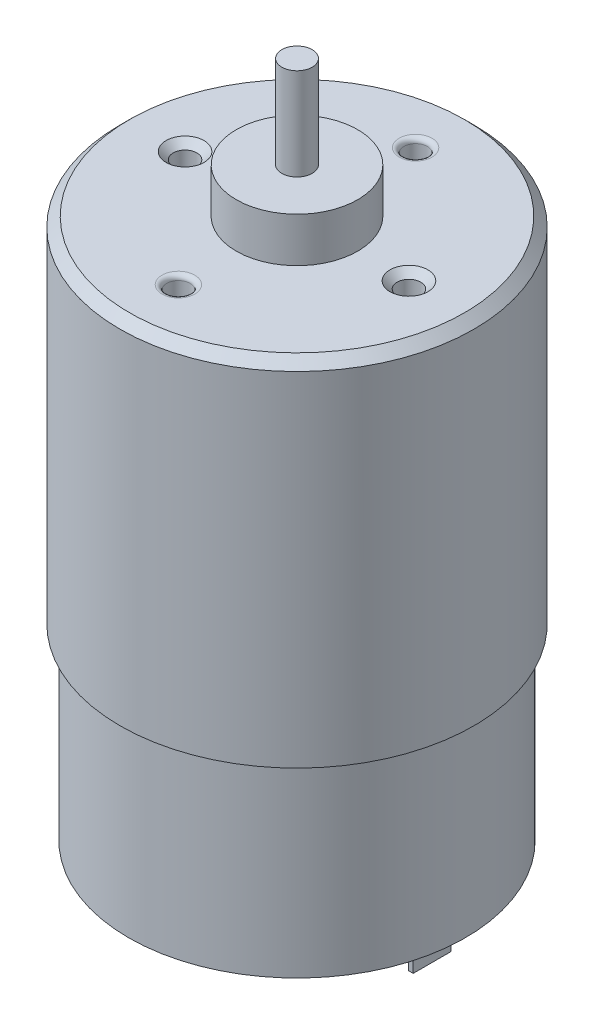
ISO-10303-21;
HEADER;
FILE_DESCRIPTION(('STEP AP214'),'2;1');
FILE_NAME('part.step','',(''),(''),'','','');
FILE_SCHEMA(('AUTOMOTIVE_DESIGN { 1 0 10303 214 1 1 1 1 }'));
ENDSEC;
DATA;
#1=APPLICATION_CONTEXT('core data for automotive mechanical design processes');
#2=APPLICATION_PROTOCOL_DEFINITION('international standard','automotive_design',2000,#1);
#3=PRODUCT_CONTEXT('',#1,'mechanical');
#4=PRODUCT('Part','Part','',(#3));
#5=PRODUCT_RELATED_PRODUCT_CATEGORY('part','',(#4));
#6=PRODUCT_DEFINITION_FORMATION('','',#4);
#7=PRODUCT_DEFINITION_CONTEXT('part definition',#1,'design');
#8=PRODUCT_DEFINITION('design','',#6,#7);
#9=PRODUCT_DEFINITION_SHAPE('','',#8);
#10=(LENGTH_UNIT() NAMED_UNIT(*) SI_UNIT(.MILLI.,.METRE.));
#11=(NAMED_UNIT(*) PLANE_ANGLE_UNIT() SI_UNIT($,.RADIAN.));
#12=(NAMED_UNIT(*) SI_UNIT($,.STERADIAN.) SOLID_ANGLE_UNIT());
#13=UNCERTAINTY_MEASURE_WITH_UNIT(LENGTH_MEASURE(1.E-05),#10,'distance_accuracy_value','');
#14=(GEOMETRIC_REPRESENTATION_CONTEXT(3) GLOBAL_UNCERTAINTY_ASSIGNED_CONTEXT((#13)) GLOBAL_UNIT_ASSIGNED_CONTEXT((#10,
#11,#12)) REPRESENTATION_CONTEXT('',''));
#15=CARTESIAN_POINT('',(0.,0.,0.));
#16=DIRECTION('',(0.,0.,1.));
#17=DIRECTION('',(1.,0.,0.));
#18=AXIS2_PLACEMENT_3D('',#15,#16,#17);
#19=CARTESIAN_POINT('',(-1.63199999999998,75.,-1.59999999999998));
#20=DIRECTION('',(0.,1.,0.));
#21=DIRECTION('',(0.,0.,1.));
#22=AXIS2_PLACEMENT_3D('',#19,#20,#21);
#23=PLANE('',#22);
#24=CARTESIAN_POINT('',(0.,75.,0.));
#25=DIRECTION('',(0.,1.,0.));
#26=DIRECTION('',(0.,0.,1.));
#27=AXIS2_PLACEMENT_3D('',#24,#25,#26);
#28=CIRCLE('',#27,1.59999999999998);
#29=CARTESIAN_POINT('',(0.,75.,1.59999999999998));
#30=VERTEX_POINT('',#29);
#31=EDGE_CURVE('E334',#30,#30,#28,.T.);
#32=ORIENTED_EDGE('',*,*,#31,.T.);
#33=EDGE_LOOP('',(#32));
#34=FACE_BOUND('',#33,.T.);
#35=ADVANCED_FACE('F21',(#34),#23,.T.);
#36=CARTESIAN_POINT('',(0.,65.3,0.));
#37=DIRECTION('',(0.,1.,0.));
#38=DIRECTION('',(0.,0.,1.));
#39=AXIS2_PLACEMENT_3D('',#36,#37,#38);
#40=CYLINDRICAL_SURFACE('',#39,1.59999999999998);
#41=ORIENTED_EDGE('',*,*,#31,.F.);
#42=EDGE_LOOP('',(#41));
#43=FACE_BOUND('',#42,.T.);
#44=CARTESIAN_POINT('',(0.,65.3,0.));
#45=DIRECTION('',(0.,1.,0.));
#46=DIRECTION('',(0.,0.,1.));
#47=AXIS2_PLACEMENT_3D('',#44,#45,#46);
#48=CIRCLE('',#47,1.59999999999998);
#49=CARTESIAN_POINT('',(0.,65.3,1.59999999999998));
#50=VERTEX_POINT('',#49);
#51=EDGE_CURVE('E330',#50,#50,#48,.T.);
#52=ORIENTED_EDGE('',*,*,#51,.T.);
#53=EDGE_LOOP('',(#52));
#54=FACE_BOUND('',#53,.T.);
#55=ADVANCED_FACE('F920',(#43,#54),#40,.T.);
#56=CARTESIAN_POINT('',(-6.528,65.3,-6.4));
#57=DIRECTION('',(0.,1.,0.));
#58=DIRECTION('',(0.,0.,1.));
#59=AXIS2_PLACEMENT_3D('',#56,#57,#58);
#60=PLANE('',#59);
#61=ORIENTED_EDGE('',*,*,#51,.F.);
#62=EDGE_LOOP('',(#61));
#63=FACE_BOUND('',#62,.T.);
#64=CARTESIAN_POINT('',(0.,65.3,0.));
#65=DIRECTION('',(0.,1.,0.));
#66=DIRECTION('',(0.,0.,1.));
#67=AXIS2_PLACEMENT_3D('',#64,#65,#66);
#68=CIRCLE('',#67,6.4);
#69=CARTESIAN_POINT('',(0.,65.3,6.4));
#70=VERTEX_POINT('',#69);
#71=EDGE_CURVE('E324',#70,#70,#68,.T.);
#72=ORIENTED_EDGE('',*,*,#71,.T.);
#73=EDGE_LOOP('',(#72));
#74=FACE_BOUND('',#73,.T.);
#75=ADVANCED_FACE('F910',(#63,#74),#60,.T.);
#76=CARTESIAN_POINT('',(0.,60.1,-12.5));
#77=DIRECTION('',(0.,-1.,0.));
#78=DIRECTION('',(0.,0.,-1.));
#79=AXIS2_PLACEMENT_3D('',#76,#77,#78);
#80=TOROIDAL_SURFACE('',#79,1.72950000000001,0.500000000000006);
#81=CARTESIAN_POINT('',(0.,60.1,-12.5));
#82=DIRECTION('',(0.,-1.,0.));
#83=DIRECTION('',(0.,0.,-1.));
#84=AXIS2_PLACEMENT_3D('',#81,#82,#83);
#85=CIRCLE('',#84,1.2295);
#86=CARTESIAN_POINT('',(0.,60.1,-13.7295));
#87=VERTEX_POINT('',#86);
#88=EDGE_CURVE('E289',#87,#87,#85,.T.);
#89=ORIENTED_EDGE('',*,*,#88,.T.);
#90=EDGE_LOOP('',(#89));
#91=FACE_BOUND('',#90,.T.);
#92=CARTESIAN_POINT('',(0.,60.6,-12.5));
#93=DIRECTION('',(0.,-1.,0.));
#94=DIRECTION('',(0.,0.,-1.));
#95=AXIS2_PLACEMENT_3D('',#92,#93,#94);
#96=CIRCLE('',#95,1.7295);
#97=CARTESIAN_POINT('',(0.,60.6,-14.2295));
#98=VERTEX_POINT('',#97);
#99=EDGE_CURVE('E25',#98,#98,#96,.F.);
#100=ORIENTED_EDGE('',*,*,#99,.T.);
#101=EDGE_LOOP('',(#100));
#102=FACE_BOUND('',#101,.T.);
#103=ADVANCED_FACE('F900',(#91,#102),#80,.T.);
#104=CARTESIAN_POINT('',(0.,51.8,-12.5));
#105=DIRECTION('',(0.,1.,0.));
#106=DIRECTION('',(0.,0.,1.));
#107=AXIS2_PLACEMENT_3D('',#104,#105,#106);
#108=CYLINDRICAL_SURFACE('',#107,1.2295);
#109=CARTESIAN_POINT('',(0.,51.8,-12.5));
#110=DIRECTION('',(0.,1.,0.));
#111=DIRECTION('',(0.,0.,1.));
#112=AXIS2_PLACEMENT_3D('',#109,#110,#111);
#113=CIRCLE('',#112,1.2295);
#114=CARTESIAN_POINT('',(0.,51.8,-11.2705));
#115=VERTEX_POINT('',#114);
#116=EDGE_CURVE('E294',#115,#115,#113,.F.);
#117=ORIENTED_EDGE('',*,*,#116,.T.);
#118=EDGE_LOOP('',(#117));
#119=FACE_BOUND('',#118,.T.);
#120=ORIENTED_EDGE('',*,*,#88,.F.);
#121=EDGE_LOOP('',(#120));
#122=FACE_BOUND('',#121,.T.);
#123=ADVANCED_FACE('F890',(#119,#122),#108,.F.);
#124=CARTESIAN_POINT('',(-18.0029999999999,60.6,-17.6499999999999));
#125=DIRECTION('',(0.,1.,0.));
#126=DIRECTION('',(0.,0.,1.));
#127=AXIS2_PLACEMENT_3D('',#124,#125,#126);
#128=PLANE('',#127);
#129=ORIENTED_EDGE('',*,*,#99,.F.);
#130=EDGE_LOOP('',(#129));
#131=FACE_BOUND('',#130,.T.);
#132=CARTESIAN_POINT('',(0.,60.6,0.));
#133=DIRECTION('',(0.,1.,0.));
#134=DIRECTION('',(0.,0.,1.));
#135=AXIS2_PLACEMENT_3D('',#132,#133,#134);
#136=CIRCLE('',#135,6.4);
#137=CARTESIAN_POINT('',(0.,60.6,6.4));
#138=VERTEX_POINT('',#137);
#139=EDGE_CURVE('E1104',#138,#138,#136,.F.);
#140=ORIENTED_EDGE('',*,*,#139,.T.);
#141=EDGE_LOOP('',(#140));
#142=FACE_BOUND('',#141,.T.);
#143=CARTESIAN_POINT('',(-11.8,60.6,0.));
#144=DIRECTION('',(0.,1.,0.));
#145=DIRECTION('',(-1.,0.,0.));
#146=AXIS2_PLACEMENT_3D('',#143,#144,#145);
#147=CIRCLE('',#146,1.99999999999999);
#148=CARTESIAN_POINT('',(-13.8,60.6,0.));
#149=VERTEX_POINT('',#148);
#150=EDGE_CURVE('E1108',#149,#149,#147,.F.);
#151=ORIENTED_EDGE('',*,*,#150,.T.);
#152=EDGE_LOOP('',(#151));
#153=FACE_BOUND('',#152,.T.);
#154=CARTESIAN_POINT('',(11.8,60.6,0.));
#155=DIRECTION('',(0.,1.,0.));
#156=DIRECTION('',(0.,0.,1.));
#157=AXIS2_PLACEMENT_3D('',#154,#155,#156);
#158=CIRCLE('',#157,1.99999999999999);
#159=CARTESIAN_POINT('',(11.8,60.6,1.99999999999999));
#160=VERTEX_POINT('',#159);
#161=EDGE_CURVE('E307',#160,#160,#158,.F.);
#162=ORIENTED_EDGE('',*,*,#161,.T.);
#163=EDGE_LOOP('',(#162));
#164=FACE_BOUND('',#163,.T.);
#165=CARTESIAN_POINT('',(0.,60.6,12.5));
#166=DIRECTION('',(0.,-1.,0.));
#167=DIRECTION('',(0.,0.,-1.));
#168=AXIS2_PLACEMENT_3D('',#165,#166,#167);
#169=CIRCLE('',#168,1.7295);
#170=CARTESIAN_POINT('',(0.,60.6,10.7705));
#171=VERTEX_POINT('',#170);
#172=EDGE_CURVE('E302',#171,#171,#169,.T.);
#173=ORIENTED_EDGE('',*,*,#172,.T.);
#174=EDGE_LOOP('',(#173));
#175=FACE_BOUND('',#174,.T.);
#176=CARTESIAN_POINT('',(0.,60.6,0.));
#177=DIRECTION('',(0.,-1.,0.));
#178=DIRECTION('',(0.,0.,-1.));
#179=AXIS2_PLACEMENT_3D('',#176,#177,#178);
#180=CIRCLE('',#179,17.6499999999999);
#181=CARTESIAN_POINT('',(0.,60.6,-17.6499999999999));
#182=VERTEX_POINT('',#181);
#183=EDGE_CURVE('E298',#182,#182,#180,.F.);
#184=ORIENTED_EDGE('',*,*,#183,.T.);
#185=EDGE_LOOP('',(#184));
#186=FACE_BOUND('',#185,.T.);
#187=ADVANCED_FACE('F880',(#131,#142,#153,#164,#175,#186),#128,.T.);
#188=CARTESIAN_POINT('',(0.,60.6,0.));
#189=DIRECTION('',(0.,1.,0.));
#190=DIRECTION('',(0.,0.,1.));
#191=AXIS2_PLACEMENT_3D('',#188,#189,#190);
#192=CYLINDRICAL_SURFACE('',#191,6.4);
#193=ORIENTED_EDGE('',*,*,#71,.F.);
#194=EDGE_LOOP('',(#193));
#195=FACE_BOUND('',#194,.T.);
#196=ORIENTED_EDGE('',*,*,#139,.F.);
#197=EDGE_LOOP('',(#196));
#198=FACE_BOUND('',#197,.T.);
#199=ADVANCED_FACE('F870',(#195,#198),#192,.T.);
#200=CARTESIAN_POINT('',(-11.8,59.85,0.));
#201=DIRECTION('',(0.,1.,0.));
#202=DIRECTION('',(-1.,0.,0.));
#203=AXIS2_PLACEMENT_3D('',#200,#201,#202);
#204=CONICAL_SURFACE('',#203,1.25,0.785398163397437);
#205=CARTESIAN_POINT('',(-11.8,59.85,0.));
#206=DIRECTION('',(0.,1.,0.));
#207=DIRECTION('',(-1.,0.,0.));
#208=AXIS2_PLACEMENT_3D('',#205,#206,#207);
#209=CIRCLE('',#208,1.24999999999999);
#210=CARTESIAN_POINT('',(-13.05,59.85,0.));
#211=VERTEX_POINT('',#210);
#212=EDGE_CURVE('E1100',#211,#211,#209,.F.);
#213=ORIENTED_EDGE('',*,*,#212,.T.);
#214=EDGE_LOOP('',(#213));
#215=FACE_BOUND('',#214,.T.);
#216=ORIENTED_EDGE('',*,*,#150,.F.);
#217=EDGE_LOOP('',(#216));
#218=FACE_BOUND('',#217,.T.);
#219=ADVANCED_FACE('F860',(#215,#218),#204,.F.);
#220=CARTESIAN_POINT('',(11.8,59.85,0.));
#221=DIRECTION('',(0.,1.,0.));
#222=DIRECTION('',(0.,0.,1.));
#223=AXIS2_PLACEMENT_3D('',#220,#221,#222);
#224=CONICAL_SURFACE('',#223,1.25,0.785398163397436);
#225=CARTESIAN_POINT('',(11.8,59.85,0.));
#226=DIRECTION('',(0.,1.,0.));
#227=DIRECTION('',(0.,0.,1.));
#228=AXIS2_PLACEMENT_3D('',#225,#226,#227);
#229=CIRCLE('',#228,1.24999999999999);
#230=CARTESIAN_POINT('',(11.8,59.85,1.24999999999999));
#231=VERTEX_POINT('',#230);
#232=EDGE_CURVE('E1097',#231,#231,#229,.F.);
#233=ORIENTED_EDGE('',*,*,#232,.T.);
#234=EDGE_LOOP('',(#233));
#235=FACE_BOUND('',#234,.T.);
#236=ORIENTED_EDGE('',*,*,#161,.F.);
#237=EDGE_LOOP('',(#236));
#238=FACE_BOUND('',#237,.T.);
#239=ADVANCED_FACE('F850',(#235,#238),#224,.F.);
#240=CARTESIAN_POINT('',(0.,60.1,12.5));
#241=DIRECTION('',(0.,-1.,0.));
#242=DIRECTION('',(0.,0.,-1.));
#243=AXIS2_PLACEMENT_3D('',#240,#241,#242);
#244=TOROIDAL_SURFACE('',#243,1.72950000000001,0.500000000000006);
#245=CARTESIAN_POINT('',(0.,60.1,12.5));
#246=DIRECTION('',(0.,-1.,0.));
#247=DIRECTION('',(0.,0.,-1.));
#248=AXIS2_PLACEMENT_3D('',#245,#246,#247);
#249=CIRCLE('',#248,1.2295);
#250=CARTESIAN_POINT('',(0.,60.1,11.2705));
#251=VERTEX_POINT('',#250);
#252=EDGE_CURVE('E1093',#251,#251,#249,.T.);
#253=ORIENTED_EDGE('',*,*,#252,.T.);
#254=EDGE_LOOP('',(#253));
#255=FACE_BOUND('',#254,.T.);
#256=ORIENTED_EDGE('',*,*,#172,.F.);
#257=EDGE_LOOP('',(#256));
#258=FACE_BOUND('',#257,.T.);
#259=ADVANCED_FACE('F840',(#255,#258),#244,.T.);
#260=CARTESIAN_POINT('',(0.,59.6,0.));
#261=DIRECTION('',(0.,-1.,0.));
#262=DIRECTION('',(0.,0.,-1.));
#263=AXIS2_PLACEMENT_3D('',#260,#261,#262);
#264=CONICAL_SURFACE('',#263,18.6499999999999,0.785398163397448);
#265=ORIENTED_EDGE('',*,*,#183,.F.);
#266=EDGE_LOOP('',(#265));
#267=FACE_BOUND('',#266,.T.);
#268=CARTESIAN_POINT('',(0.,59.5999999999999,0.));
#269=DIRECTION('',(0.,-1.,0.));
#270=DIRECTION('',(0.,0.,-1.));
#271=AXIS2_PLACEMENT_3D('',#268,#269,#270);
#272=CIRCLE('',#271,18.65);
#273=CARTESIAN_POINT('',(0.,59.5999999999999,-18.65));
#274=VERTEX_POINT('',#273);
#275=EDGE_CURVE('E1089',#274,#274,#272,.F.);
#276=ORIENTED_EDGE('',*,*,#275,.T.);
#277=EDGE_LOOP('',(#276));
#278=FACE_BOUND('',#277,.T.);
#279=ADVANCED_FACE('F830',(#267,#278),#264,.T.);
#280=CARTESIAN_POINT('',(0.,51.0612418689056,-12.5));
#281=DIRECTION('',(0.,1.,0.));
#282=DIRECTION('',(0.,0.,1.));
#283=AXIS2_PLACEMENT_3D('',#280,#281,#282);
#284=CONICAL_SURFACE('',#283,0.,1.02974425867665);
#285=ORIENTED_EDGE('',*,*,#116,.F.);
#286=EDGE_LOOP('',(#285));
#287=FACE_BOUND('',#286,.T.);
#288=CARTESIAN_POINT('',(0.,51.0612418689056,-12.5));
#289=VERTEX_POINT('',#288);
#290=VERTEX_LOOP('',#289);
#291=FACE_BOUND('',#290,.T.);
#292=ADVANCED_FACE('F820',(#287,#291),#284,.F.);
#293=CARTESIAN_POINT('',(0.,51.8,12.5));
#294=DIRECTION('',(0.,1.,0.));
#295=DIRECTION('',(0.,0.,1.));
#296=AXIS2_PLACEMENT_3D('',#293,#294,#295);
#297=CYLINDRICAL_SURFACE('',#296,1.2295);
#298=CARTESIAN_POINT('',(0.,51.8,12.5));
#299=DIRECTION('',(0.,1.,0.));
#300=DIRECTION('',(0.,0.,1.));
#301=AXIS2_PLACEMENT_3D('',#298,#299,#300);
#302=CIRCLE('',#301,1.2295);
#303=CARTESIAN_POINT('',(0.,51.8,13.7295));
#304=VERTEX_POINT('',#303);
#305=EDGE_CURVE('E1085',#304,#304,#302,.F.);
#306=ORIENTED_EDGE('',*,*,#305,.T.);
#307=EDGE_LOOP('',(#306));
#308=FACE_BOUND('',#307,.T.);
#309=ORIENTED_EDGE('',*,*,#252,.F.);
#310=EDGE_LOOP('',(#309));
#311=FACE_BOUND('',#310,.T.);
#312=ADVANCED_FACE('F810',(#308,#311),#297,.F.);
#313=CARTESIAN_POINT('',(0.,51.0612418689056,12.5));
#314=DIRECTION('',(0.,1.,0.));
#315=DIRECTION('',(0.,0.,1.));
#316=AXIS2_PLACEMENT_3D('',#313,#314,#315);
#317=CONICAL_SURFACE('',#316,0.,1.02974425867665);
#318=ORIENTED_EDGE('',*,*,#305,.F.);
#319=EDGE_LOOP('',(#318));
#320=FACE_BOUND('',#319,.T.);
#321=CARTESIAN_POINT('',(0.,51.0612418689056,12.5));
#322=VERTEX_POINT('',#321);
#323=VERTEX_LOOP('',#322);
#324=FACE_BOUND('',#323,.T.);
#325=ADVANCED_FACE('F800',(#320,#324),#317,.F.);
#326=CARTESIAN_POINT('',(11.8,51.0489242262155,0.));
#327=DIRECTION('',(0.,1.,0.));
#328=DIRECTION('',(0.,0.,1.));
#329=AXIS2_PLACEMENT_3D('',#326,#327,#328);
#330=CONICAL_SURFACE('',#329,0.,1.02974425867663);
#331=CARTESIAN_POINT('',(11.8,51.8,0.));
#332=DIRECTION('',(0.,1.,0.));
#333=DIRECTION('',(0.,0.,1.));
#334=AXIS2_PLACEMENT_3D('',#331,#332,#333);
#335=CIRCLE('',#334,1.25);
#336=CARTESIAN_POINT('',(11.8,51.8,1.25));
#337=VERTEX_POINT('',#336);
#338=EDGE_CURVE('E344',#337,#337,#335,.T.);
#339=ORIENTED_EDGE('',*,*,#338,.T.);
#340=EDGE_LOOP('',(#339));
#341=FACE_BOUND('',#340,.T.);
#342=CARTESIAN_POINT('',(11.8,51.0489242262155,0.));
#343=VERTEX_POINT('',#342);
#344=VERTEX_LOOP('',#343);
#345=FACE_BOUND('',#344,.T.);
#346=ADVANCED_FACE('F790',(#341,#345),#330,.F.);
#347=CARTESIAN_POINT('',(11.8,51.8,0.));
#348=DIRECTION('',(0.,1.,0.));
#349=DIRECTION('',(0.,0.,1.));
#350=AXIS2_PLACEMENT_3D('',#347,#348,#349);
#351=CYLINDRICAL_SURFACE('',#350,1.25);
#352=ORIENTED_EDGE('',*,*,#338,.F.);
#353=EDGE_LOOP('',(#352));
#354=FACE_BOUND('',#353,.T.);
#355=ORIENTED_EDGE('',*,*,#232,.F.);
#356=EDGE_LOOP('',(#355));
#357=FACE_BOUND('',#356,.T.);
#358=ADVANCED_FACE('F780',(#354,#357),#351,.F.);
#359=CARTESIAN_POINT('',(-11.8,51.0489242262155,0.));
#360=DIRECTION('',(0.,1.,0.));
#361=DIRECTION('',(0.,0.,1.));
#362=AXIS2_PLACEMENT_3D('',#359,#360,#361);
#363=CONICAL_SURFACE('',#362,0.,1.02974425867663);
#364=CARTESIAN_POINT('',(-11.8,51.8,0.));
#365=DIRECTION('',(0.,1.,0.));
#366=DIRECTION('',(0.,0.,1.));
#367=AXIS2_PLACEMENT_3D('',#364,#365,#366);
#368=CIRCLE('',#367,1.25);
#369=CARTESIAN_POINT('',(-11.8,51.8,1.25));
#370=VERTEX_POINT('',#369);
#371=EDGE_CURVE('E339',#370,#370,#368,.T.);
#372=ORIENTED_EDGE('',*,*,#371,.T.);
#373=EDGE_LOOP('',(#372));
#374=FACE_BOUND('',#373,.T.);
#375=CARTESIAN_POINT('',(-11.8,51.0489242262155,0.));
#376=VERTEX_POINT('',#375);
#377=VERTEX_LOOP('',#376);
#378=FACE_BOUND('',#377,.T.);
#379=ADVANCED_FACE('F770',(#374,#378),#363,.F.);
#380=CARTESIAN_POINT('',(-11.8,51.8,0.));
#381=DIRECTION('',(0.,1.,0.));
#382=DIRECTION('',(0.,0.,1.));
#383=AXIS2_PLACEMENT_3D('',#380,#381,#382);
#384=CYLINDRICAL_SURFACE('',#383,1.25);
#385=ORIENTED_EDGE('',*,*,#371,.F.);
#386=EDGE_LOOP('',(#385));
#387=FACE_BOUND('',#386,.T.);
#388=ORIENTED_EDGE('',*,*,#212,.F.);
#389=EDGE_LOOP('',(#388));
#390=FACE_BOUND('',#389,.T.);
#391=ADVANCED_FACE('F760',(#387,#390),#384,.F.);
#392=CARTESIAN_POINT('',(0.,23.4,0.));
#393=DIRECTION('',(0.,1.,0.));
#394=DIRECTION('',(0.,0.,1.));
#395=AXIS2_PLACEMENT_3D('',#392,#393,#394);
#396=CYLINDRICAL_SURFACE('',#395,18.65);
#397=ORIENTED_EDGE('',*,*,#275,.F.);
#398=EDGE_LOOP('',(#397));
#399=FACE_BOUND('',#398,.T.);
#400=CARTESIAN_POINT('',(0.,23.4,0.));
#401=DIRECTION('',(0.,1.,0.));
#402=DIRECTION('',(0.,0.,1.));
#403=AXIS2_PLACEMENT_3D('',#400,#401,#402);
#404=CIRCLE('',#403,18.65);
#405=CARTESIAN_POINT('',(0.,23.4,18.65));
#406=VERTEX_POINT('',#405);
#407=EDGE_CURVE('E318',#406,#406,#404,.T.);
#408=ORIENTED_EDGE('',*,*,#407,.T.);
#409=EDGE_LOOP('',(#408));
#410=FACE_BOUND('',#409,.T.);
#411=ADVANCED_FACE('F750',(#399,#410),#396,.T.);
#412=CARTESIAN_POINT('',(-19.023,23.4,18.65));
#413=DIRECTION('',(0.,-1.,0.));
#414=DIRECTION('',(0.,0.,-1.));
#415=AXIS2_PLACEMENT_3D('',#412,#413,#414);
#416=PLANE('',#415);
#417=CARTESIAN_POINT('',(0.,23.4,0.));
#418=DIRECTION('',(0.,1.,0.));
#419=DIRECTION('',(0.,0.,1.));
#420=AXIS2_PLACEMENT_3D('',#417,#418,#419);
#421=CIRCLE('',#420,17.75);
#422=CARTESIAN_POINT('',(0.,23.4,17.75));
#423=VERTEX_POINT('',#422);
#424=EDGE_CURVE('E323',#423,#423,#421,.T.);
#425=ORIENTED_EDGE('',*,*,#424,.T.);
#426=EDGE_LOOP('',(#425));
#427=FACE_BOUND('',#426,.T.);
#428=ORIENTED_EDGE('',*,*,#407,.F.);
#429=EDGE_LOOP('',(#428));
#430=FACE_BOUND('',#429,.T.);
#431=ADVANCED_FACE('F740',(#427,#430),#416,.T.);
#432=CARTESIAN_POINT('',(0.,3.6,0.));
#433=DIRECTION('',(0.,1.,0.));
#434=DIRECTION('',(0.,0.,1.));
#435=AXIS2_PLACEMENT_3D('',#432,#433,#434);
#436=CYLINDRICAL_SURFACE('',#435,17.75);
#437=ORIENTED_EDGE('',*,*,#424,.F.);
#438=EDGE_LOOP('',(#437));
#439=FACE_BOUND('',#438,.T.);
#440=CARTESIAN_POINT('',(0.,3.59999999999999,0.));
#441=DIRECTION('',(0.,1.,0.));
#442=DIRECTION('',(0.,0.,1.));
#443=AXIS2_PLACEMENT_3D('',#440,#441,#442);
#444=CIRCLE('',#443,17.75);
#445=CARTESIAN_POINT('',(0.,3.59999999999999,17.75));
#446=VERTEX_POINT('',#445);
#447=EDGE_CURVE('E1152',#446,#446,#444,.T.);
#448=ORIENTED_EDGE('',*,*,#447,.T.);
#449=EDGE_LOOP('',(#448));
#450=FACE_BOUND('',#449,.T.);
#451=ADVANCED_FACE('F730',(#439,#450),#436,.T.);
#452=CARTESIAN_POINT('',(14.25,3.59999999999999,-2.));
#453=DIRECTION('',(1.,0.,0.));
#454=DIRECTION('',(0.,0.,1.));
#455=AXIS2_PLACEMENT_3D('',#452,#453,#454);
#456=PLANE('',#455);
#457=DIRECTION('',(0.,0.,1.));
#458=VECTOR('',#457,1.);
#459=CARTESIAN_POINT('',(14.25,-0.400000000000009,-2.));
#460=LINE('',#459,#458);
#461=CARTESIAN_POINT('',(14.25,-0.400000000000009,2.));
#462=VERTEX_POINT('',#461);
#463=CARTESIAN_POINT('',(14.25,-0.400000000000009,-2.));
#464=VERTEX_POINT('',#463);
#465=EDGE_CURVE('E1024',#462,#464,#460,.F.);
#466=ORIENTED_EDGE('',*,*,#465,.T.);
#467=DIRECTION('',(0.,-1.,0.));
#468=VECTOR('',#467,1.);
#469=CARTESIAN_POINT('',(14.25,3.59999999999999,-2.));
#470=LINE('',#469,#468);
#471=CARTESIAN_POINT('',(14.25,3.59999999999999,-2.));
#472=VERTEX_POINT('',#471);
#473=EDGE_CURVE('E1020',#464,#472,#470,.F.);
#474=ORIENTED_EDGE('',*,*,#473,.T.);
#475=DIRECTION('',(0.,0.,1.));
#476=VECTOR('',#475,1.);
#477=CARTESIAN_POINT('',(14.25,3.59999999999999,-2.));
#478=LINE('',#477,#476);
#479=CARTESIAN_POINT('',(14.25,3.59999999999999,2.));
#480=VERTEX_POINT('',#479);
#481=EDGE_CURVE('E1032',#472,#480,#478,.T.);
#482=ORIENTED_EDGE('',*,*,#481,.T.);
#483=DIRECTION('',(0.,-1.,0.));
#484=VECTOR('',#483,1.);
#485=CARTESIAN_POINT('',(14.25,3.59999999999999,2.));
#486=LINE('',#485,#484);
#487=EDGE_CURVE('E1028',#480,#462,#486,.T.);
#488=ORIENTED_EDGE('',*,*,#487,.T.);
#489=EDGE_LOOP('',(#466,#474,#482,#488));
#490=FACE_BOUND('',#489,.T.);
#491=ADVANCED_FACE('F720',(#490),#456,.T.);
#492=CARTESIAN_POINT('',(13.75,3.59999999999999,-2.));
#493=DIRECTION('',(0.,0.,-1.));
#494=DIRECTION('',(1.,0.,0.));
#495=AXIS2_PLACEMENT_3D('',#492,#493,#494);
#496=PLANE('',#495);
#497=DIRECTION('',(1.,0.,0.));
#498=VECTOR('',#497,1.);
#499=CARTESIAN_POINT('',(13.75,-0.400000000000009,-2.));
#500=LINE('',#499,#498);
#501=CARTESIAN_POINT('',(13.75,-0.400000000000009,-2.));
#502=VERTEX_POINT('',#501);
#503=EDGE_CURVE('E1012',#464,#502,#500,.F.);
#504=ORIENTED_EDGE('',*,*,#503,.T.);
#505=DIRECTION('',(0.,-1.,0.));
#506=VECTOR('',#505,1.);
#507=CARTESIAN_POINT('',(13.75,3.59999999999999,-2.));
#508=LINE('',#507,#506);
#509=CARTESIAN_POINT('',(13.75,3.59999999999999,-2.));
#510=VERTEX_POINT('',#509);
#511=EDGE_CURVE('E1008',#502,#510,#508,.F.);
#512=ORIENTED_EDGE('',*,*,#511,.T.);
#513=DIRECTION('',(1.,0.,0.));
#514=VECTOR('',#513,1.);
#515=CARTESIAN_POINT('',(13.75,3.59999999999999,-2.));
#516=LINE('',#515,#514);
#517=EDGE_CURVE('E1016',#510,#472,#516,.T.);
#518=ORIENTED_EDGE('',*,*,#517,.T.);
#519=ORIENTED_EDGE('',*,*,#473,.F.);
#520=EDGE_LOOP('',(#504,#512,#518,#519));
#521=FACE_BOUND('',#520,.T.);
#522=ADVANCED_FACE('F710',(#521),#496,.T.);
#523=CARTESIAN_POINT('',(13.75,-0.400000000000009,2.));
#524=DIRECTION('',(0.,-1.,0.));
#525=DIRECTION('',(0.,0.,-1.));
#526=AXIS2_PLACEMENT_3D('',#523,#524,#525);
#527=PLANE('',#526);
#528=ORIENTED_EDGE('',*,*,#503,.F.);
#529=ORIENTED_EDGE('',*,*,#465,.F.);
#530=DIRECTION('',(-1.,0.,0.));
#531=VECTOR('',#530,1.);
#532=CARTESIAN_POINT('',(14.25,-0.400000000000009,2.));
#533=LINE('',#532,#531);
#534=CARTESIAN_POINT('',(13.75,-0.400000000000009,2.));
#535=VERTEX_POINT('',#534);
#536=EDGE_CURVE('E1000',#535,#462,#533,.F.);
#537=ORIENTED_EDGE('',*,*,#536,.F.);
#538=DIRECTION('',(0.,0.,-1.));
#539=VECTOR('',#538,1.);
#540=CARTESIAN_POINT('',(13.75,-0.400000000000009,2.));
#541=LINE('',#540,#539);
#542=EDGE_CURVE('E993',#502,#535,#541,.F.);
#543=ORIENTED_EDGE('',*,*,#542,.F.);
#544=EDGE_LOOP('',(#528,#529,#537,#543));
#545=FACE_BOUND('',#544,.T.);
#546=ADVANCED_FACE('F700',(#545),#527,.T.);
#547=CARTESIAN_POINT('',(14.25,3.59999999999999,2.));
#548=DIRECTION('',(0.,0.,1.));
#549=DIRECTION('',(-1.,0.,0.));
#550=AXIS2_PLACEMENT_3D('',#547,#548,#549);
#551=PLANE('',#550);
#552=ORIENTED_EDGE('',*,*,#536,.T.);
#553=ORIENTED_EDGE('',*,*,#487,.F.);
#554=DIRECTION('',(-1.,0.,0.));
#555=VECTOR('',#554,1.);
#556=CARTESIAN_POINT('',(14.25,3.59999999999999,2.));
#557=LINE('',#556,#555);
#558=CARTESIAN_POINT('',(13.75,3.59999999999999,2.));
#559=VERTEX_POINT('',#558);
#560=EDGE_CURVE('E1004',#480,#559,#557,.T.);
#561=ORIENTED_EDGE('',*,*,#560,.T.);
#562=DIRECTION('',(0.,-1.,0.));
#563=VECTOR('',#562,1.);
#564=CARTESIAN_POINT('',(13.75,3.59999999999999,2.));
#565=LINE('',#564,#563);
#566=EDGE_CURVE('E990',#535,#559,#565,.F.);
#567=ORIENTED_EDGE('',*,*,#566,.F.);
#568=EDGE_LOOP('',(#552,#553,#561,#567));
#569=FACE_BOUND('',#568,.T.);
#570=ADVANCED_FACE('F690',(#569),#551,.T.);
#571=CARTESIAN_POINT('',(-13.75,3.59999999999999,-2.));
#572=DIRECTION('',(1.,0.,0.));
#573=DIRECTION('',(0.,0.,1.));
#574=AXIS2_PLACEMENT_3D('',#571,#572,#573);
#575=PLANE('',#574);
#576=DIRECTION('',(0.,0.,1.));
#577=VECTOR('',#576,1.);
#578=CARTESIAN_POINT('',(-13.75,-0.400000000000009,-2.));
#579=LINE('',#578,#577);
#580=CARTESIAN_POINT('',(-13.75,-0.400000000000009,2.));
#581=VERTEX_POINT('',#580);
#582=CARTESIAN_POINT('',(-13.75,-0.400000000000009,-2.));
#583=VERTEX_POINT('',#582);
#584=EDGE_CURVE('E1075',#581,#583,#579,.F.);
#585=ORIENTED_EDGE('',*,*,#584,.T.);
#586=DIRECTION('',(0.,-1.,0.));
#587=VECTOR('',#586,1.);
#588=CARTESIAN_POINT('',(-13.75,3.59999999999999,-2.));
#589=LINE('',#588,#587);
#590=CARTESIAN_POINT('',(-13.75,3.59999999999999,-2.));
#591=VERTEX_POINT('',#590);
#592=EDGE_CURVE('E1072',#583,#591,#589,.F.);
#593=ORIENTED_EDGE('',*,*,#592,.T.);
#594=DIRECTION('',(0.,0.,1.));
#595=VECTOR('',#594,1.);
#596=CARTESIAN_POINT('',(-13.75,3.59999999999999,-2.));
#597=LINE('',#596,#595);
#598=CARTESIAN_POINT('',(-13.75,3.59999999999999,2.));
#599=VERTEX_POINT('',#598);
#600=EDGE_CURVE('E98',#591,#599,#597,.T.);
#601=ORIENTED_EDGE('',*,*,#600,.T.);
#602=DIRECTION('',(0.,-1.,0.));
#603=VECTOR('',#602,1.);
#604=CARTESIAN_POINT('',(-13.75,3.59999999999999,2.));
#605=LINE('',#604,#603);
#606=EDGE_CURVE('E1079',#599,#581,#605,.T.);
#607=ORIENTED_EDGE('',*,*,#606,.T.);
#608=EDGE_LOOP('',(#585,#593,#601,#607));
#609=FACE_BOUND('',#608,.T.);
#610=ADVANCED_FACE('F680',(#609),#575,.T.);
#611=CARTESIAN_POINT('',(-14.25,3.59999999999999,-2.));
#612=DIRECTION('',(0.,0.,-1.));
#613=DIRECTION('',(1.,0.,0.));
#614=AXIS2_PLACEMENT_3D('',#611,#612,#613);
#615=PLANE('',#614);
#616=DIRECTION('',(1.,0.,0.));
#617=VECTOR('',#616,1.);
#618=CARTESIAN_POINT('',(-14.25,-0.400000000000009,-2.));
#619=LINE('',#618,#617);
#620=CARTESIAN_POINT('',(-14.25,-0.400000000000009,-2.));
#621=VERTEX_POINT('',#620);
#622=EDGE_CURVE('E1064',#583,#621,#619,.F.);
#623=ORIENTED_EDGE('',*,*,#622,.T.);
#624=DIRECTION('',(0.,-1.,0.));
#625=VECTOR('',#624,1.);
#626=CARTESIAN_POINT('',(-14.25,3.59999999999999,-2.));
#627=LINE('',#626,#625);
#628=CARTESIAN_POINT('',(-14.25,3.59999999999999,-2.));
#629=VERTEX_POINT('',#628);
#630=EDGE_CURVE('E1060',#621,#629,#627,.F.);
#631=ORIENTED_EDGE('',*,*,#630,.T.);
#632=DIRECTION('',(1.,0.,0.));
#633=VECTOR('',#632,1.);
#634=CARTESIAN_POINT('',(-14.25,3.59999999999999,-2.));
#635=LINE('',#634,#633);
#636=EDGE_CURVE('E1068',#629,#591,#635,.T.);
#637=ORIENTED_EDGE('',*,*,#636,.T.);
#638=ORIENTED_EDGE('',*,*,#592,.F.);
#639=EDGE_LOOP('',(#623,#631,#637,#638));
#640=FACE_BOUND('',#639,.T.);
#641=ADVANCED_FACE('F670',(#640),#615,.T.);
#642=CARTESIAN_POINT('',(-14.25,-0.400000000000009,2.));
#643=DIRECTION('',(0.,-1.,0.));
#644=DIRECTION('',(0.,0.,-1.));
#645=AXIS2_PLACEMENT_3D('',#642,#643,#644);
#646=PLANE('',#645);
#647=ORIENTED_EDGE('',*,*,#622,.F.);
#648=ORIENTED_EDGE('',*,*,#584,.F.);
#649=DIRECTION('',(-1.,0.,0.));
#650=VECTOR('',#649,1.);
#651=CARTESIAN_POINT('',(-13.75,-0.400000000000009,2.));
#652=LINE('',#651,#650);
#653=CARTESIAN_POINT('',(-14.25,-0.400000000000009,2.));
#654=VERTEX_POINT('',#653);
#655=EDGE_CURVE('E1052',#654,#581,#652,.F.);
#656=ORIENTED_EDGE('',*,*,#655,.F.);
#657=DIRECTION('',(0.,0.,-1.));
#658=VECTOR('',#657,1.);
#659=CARTESIAN_POINT('',(-14.25,-0.400000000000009,2.));
#660=LINE('',#659,#658);
#661=EDGE_CURVE('E1040',#621,#654,#660,.F.);
#662=ORIENTED_EDGE('',*,*,#661,.F.);
#663=EDGE_LOOP('',(#647,#648,#656,#662));
#664=FACE_BOUND('',#663,.T.);
#665=ADVANCED_FACE('F660',(#664),#646,.T.);
#666=CARTESIAN_POINT('',(-13.75,3.59999999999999,2.));
#667=DIRECTION('',(0.,0.,1.));
#668=DIRECTION('',(-1.,0.,0.));
#669=AXIS2_PLACEMENT_3D('',#666,#667,#668);
#670=PLANE('',#669);
#671=ORIENTED_EDGE('',*,*,#655,.T.);
#672=ORIENTED_EDGE('',*,*,#606,.F.);
#673=DIRECTION('',(-1.,0.,0.));
#674=VECTOR('',#673,1.);
#675=CARTESIAN_POINT('',(-13.75,3.59999999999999,2.));
#676=LINE('',#675,#674);
#677=CARTESIAN_POINT('',(-14.25,3.59999999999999,2.));
#678=VERTEX_POINT('',#677);
#679=EDGE_CURVE('E1056',#599,#678,#676,.T.);
#680=ORIENTED_EDGE('',*,*,#679,.T.);
#681=DIRECTION('',(0.,-1.,0.));
#682=VECTOR('',#681,1.);
#683=CARTESIAN_POINT('',(-14.25,3.59999999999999,2.));
#684=LINE('',#683,#682);
#685=EDGE_CURVE('E1036',#654,#678,#684,.F.);
#686=ORIENTED_EDGE('',*,*,#685,.F.);
#687=EDGE_LOOP('',(#671,#672,#680,#686));
#688=FACE_BOUND('',#687,.T.);
#689=ADVANCED_FACE('F650',(#688),#670,.T.);
#690=CARTESIAN_POINT('',(-18.105,3.59999999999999,17.75));
#691=DIRECTION('',(0.,-1.,0.));
#692=DIRECTION('',(0.,0.,-1.));
#693=AXIS2_PLACEMENT_3D('',#690,#691,#692);
#694=PLANE('',#693);
#695=CARTESIAN_POINT('',(0.,3.59999999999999,0.));
#696=DIRECTION('',(0.,1.,0.));
#697=DIRECTION('',(0.,0.,1.));
#698=AXIS2_PLACEMENT_3D('',#695,#696,#697);
#699=CIRCLE('',#698,5.5);
#700=CARTESIAN_POINT('',(0.,3.59999999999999,5.5));
#701=VERTEX_POINT('',#700);
#702=EDGE_CURVE('E1048',#701,#701,#699,.T.);
#703=ORIENTED_EDGE('',*,*,#702,.T.);
#704=EDGE_LOOP('',(#703));
#705=FACE_BOUND('',#704,.T.);
#706=DIRECTION('',(0.,0.,-1.));
#707=VECTOR('',#706,1.);
#708=CARTESIAN_POINT('',(13.75,3.59999999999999,2.));
#709=LINE('',#708,#707);
#710=EDGE_CURVE('E996',#559,#510,#709,.T.);
#711=ORIENTED_EDGE('',*,*,#710,.F.);
#712=ORIENTED_EDGE('',*,*,#560,.F.);
#713=ORIENTED_EDGE('',*,*,#481,.F.);
#714=ORIENTED_EDGE('',*,*,#517,.F.);
#715=EDGE_LOOP('',(#711,#712,#713,#714));
#716=FACE_BOUND('',#715,.T.);
#717=DIRECTION('',(0.,0.,-1.));
#718=VECTOR('',#717,1.);
#719=CARTESIAN_POINT('',(-14.25,3.59999999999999,2.));
#720=LINE('',#719,#718);
#721=EDGE_CURVE('E1044',#678,#629,#720,.T.);
#722=ORIENTED_EDGE('',*,*,#721,.F.);
#723=ORIENTED_EDGE('',*,*,#679,.F.);
#724=ORIENTED_EDGE('',*,*,#600,.F.);
#725=ORIENTED_EDGE('',*,*,#636,.F.);
#726=EDGE_LOOP('',(#722,#723,#724,#725));
#727=FACE_BOUND('',#726,.T.);
#728=ORIENTED_EDGE('',*,*,#447,.F.);
#729=EDGE_LOOP('',(#728));
#730=FACE_BOUND('',#729,.T.);
#731=ADVANCED_FACE('F640',(#705,#716,#727,#730),#694,.T.);
#732=CARTESIAN_POINT('',(-14.25,3.59999999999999,2.));
#733=DIRECTION('',(-1.,0.,0.));
#734=DIRECTION('',(0.,0.,-1.));
#735=AXIS2_PLACEMENT_3D('',#732,#733,#734);
#736=PLANE('',#735);
#737=ORIENTED_EDGE('',*,*,#661,.T.);
#738=ORIENTED_EDGE('',*,*,#685,.T.);
#739=ORIENTED_EDGE('',*,*,#721,.T.);
#740=ORIENTED_EDGE('',*,*,#630,.F.);
#741=EDGE_LOOP('',(#737,#738,#739,#740));
#742=FACE_BOUND('',#741,.T.);
#743=ADVANCED_FACE('F630',(#742),#736,.T.);
#744=CARTESIAN_POINT('',(13.75,3.59999999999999,2.));
#745=DIRECTION('',(-1.,0.,0.));
#746=DIRECTION('',(0.,0.,-1.));
#747=AXIS2_PLACEMENT_3D('',#744,#745,#746);
#748=PLANE('',#747);
#749=ORIENTED_EDGE('',*,*,#542,.T.);
#750=ORIENTED_EDGE('',*,*,#566,.T.);
#751=ORIENTED_EDGE('',*,*,#710,.T.);
#752=ORIENTED_EDGE('',*,*,#511,.F.);
#753=EDGE_LOOP('',(#749,#750,#751,#752));
#754=FACE_BOUND('',#753,.T.);
#755=ADVANCED_FACE('F620',(#754),#748,.T.);
#756=CARTESIAN_POINT('',(0.,0.999999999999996,0.));
#757=DIRECTION('',(0.,1.,0.));
#758=DIRECTION('',(0.,0.,1.));
#759=AXIS2_PLACEMENT_3D('',#756,#757,#758);
#760=CYLINDRICAL_SURFACE('',#759,5.5);
#761=ORIENTED_EDGE('',*,*,#702,.F.);
#762=EDGE_LOOP('',(#761));
#763=FACE_BOUND('',#762,.T.);
#764=CARTESIAN_POINT('',(0.,1.,0.));
#765=DIRECTION('',(0.,1.,0.));
#766=DIRECTION('',(0.,0.,1.));
#767=AXIS2_PLACEMENT_3D('',#764,#765,#766);
#768=CIRCLE('',#767,5.5);
#769=CARTESIAN_POINT('',(0.,1.,5.5));
#770=VERTEX_POINT('',#769);
#771=EDGE_CURVE('E1147',#770,#770,#768,.T.);
#772=ORIENTED_EDGE('',*,*,#771,.T.);
#773=EDGE_LOOP('',(#772));
#774=FACE_BOUND('',#773,.T.);
#775=ADVANCED_FACE('F610',(#763,#774),#760,.T.);
#776=CARTESIAN_POINT('',(-5.61,1.,5.5));
#777=DIRECTION('',(0.,-1.,0.));
#778=DIRECTION('',(0.,0.,-1.));
#779=AXIS2_PLACEMENT_3D('',#776,#777,#778);
#780=PLANE('',#779);
#781=CARTESIAN_POINT('',(0.,1.,0.));
#782=DIRECTION('',(0.,1.,0.));
#783=DIRECTION('',(0.,0.,1.));
#784=AXIS2_PLACEMENT_3D('',#781,#782,#783);
#785=CIRCLE('',#784,1.6);
#786=CARTESIAN_POINT('',(0.,1.,1.6));
#787=VERTEX_POINT('',#786);
#788=EDGE_CURVE('E1151',#787,#787,#785,.T.);
#789=ORIENTED_EDGE('',*,*,#788,.T.);
#790=EDGE_LOOP('',(#789));
#791=FACE_BOUND('',#790,.T.);
#792=ORIENTED_EDGE('',*,*,#771,.F.);
#793=EDGE_LOOP('',(#792));
#794=FACE_BOUND('',#793,.T.);
#795=ADVANCED_FACE('F601',(#791,#794),#780,.T.);
#796=CARTESIAN_POINT('',(0.,0.,0.));
#797=DIRECTION('',(0.,1.,0.));
#798=DIRECTION('',(0.,0.,1.));
#799=AXIS2_PLACEMENT_3D('',#796,#797,#798);
#800=CYLINDRICAL_SURFACE('',#799,1.6);
#801=ORIENTED_EDGE('',*,*,#788,.F.);
#802=EDGE_LOOP('',(#801));
#803=FACE_BOUND('',#802,.T.);
#804=CARTESIAN_POINT('',(0.,0.,0.));
#805=DIRECTION('',(0.,1.,0.));
#806=DIRECTION('',(0.,0.,1.));
#807=AXIS2_PLACEMENT_3D('',#804,#805,#806);
#808=CIRCLE('',#807,1.6);
#809=CARTESIAN_POINT('',(0.,0.,1.6));
#810=VERTEX_POINT('',#809);
#811=EDGE_CURVE('E174',#810,#810,#808,.T.);
#812=ORIENTED_EDGE('',*,*,#811,.T.);
#813=EDGE_LOOP('',(#812));
#814=FACE_BOUND('',#813,.T.);
#815=ADVANCED_FACE('F592',(#803,#814),#800,.T.);
#816=CARTESIAN_POINT('',(-1.632,0.,1.6));
#817=DIRECTION('',(0.,-1.,0.));
#818=DIRECTION('',(0.,0.,-1.));
#819=AXIS2_PLACEMENT_3D('',#816,#817,#818);
#820=PLANE('',#819);
#821=ORIENTED_EDGE('',*,*,#811,.F.);
#822=EDGE_LOOP('',(#821));
#823=FACE_BOUND('',#822,.T.);
#824=ADVANCED_FACE('F437',(#823),#820,.T.);
#825=CLOSED_SHELL('',(#35,#55,#75,#103,#123,#187,#199,#219,#239,#259,#279,#292,#312,#325,#346,
#358,#379,#391,#411,#431,#451,#491,#522,#546,#570,#610,#641,#665,#689,#731,#743,#755,#775,#795,
#815,#824));
#826=CARTESIAN_POINT('',(-3.162,62.,3.1));
#827=DIRECTION('',(0.,-1.,0.));
#828=DIRECTION('',(0.,0.,-1.));
#829=AXIS2_PLACEMENT_3D('',#826,#827,#828);
#830=PLANE('',#829);
#831=CARTESIAN_POINT('',(0.,62.,0.));
#832=DIRECTION('',(0.,-1.,0.));
#833=DIRECTION('',(0.,0.,-1.));
#834=AXIS2_PLACEMENT_3D('',#831,#832,#833);
#835=CIRCLE('',#834,3.1);
#836=CARTESIAN_POINT('',(0.,62.,-3.1));
#837=VERTEX_POINT('',#836);
#838=EDGE_CURVE('E12',#837,#837,#835,.T.);
#839=ORIENTED_EDGE('',*,*,#838,.T.);
#840=EDGE_LOOP('',(#839));
#841=FACE_BOUND('',#840,.T.);
#842=ADVANCED_FACE('F424',(#841),#830,.T.);
#843=CARTESIAN_POINT('',(-2.244,4.3,-2.244));
#844=DIRECTION('',(0.,1.,0.));
#845=DIRECTION('',(0.,0.,1.));
#846=AXIS2_PLACEMENT_3D('',#843,#844,#845);
#847=PLANE('',#846);
#848=CARTESIAN_POINT('',(0.,4.3,0.));
#849=DIRECTION('',(0.,-1.,0.));
#850=DIRECTION('',(0.,0.,-1.));
#851=AXIS2_PLACEMENT_3D('',#848,#849,#850);
#852=CIRCLE('',#851,2.2);
#853=CARTESIAN_POINT('',(0.,4.3,-2.2));
#854=VERTEX_POINT('',#853);
#855=EDGE_CURVE('E389',#854,#854,#852,.F.);
#856=ORIENTED_EDGE('',*,*,#855,.T.);
#857=EDGE_LOOP('',(#856));
#858=FACE_BOUND('',#857,.T.);
#859=ADVANCED_FACE('F426',(#858),#847,.T.);
#860=CARTESIAN_POINT('',(0.,6.89999999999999,0.));
#861=DIRECTION('',(0.,-1.,0.));
#862=DIRECTION('',(0.,0.,-1.));
#863=AXIS2_PLACEMENT_3D('',#860,#861,#862);
#864=CYLINDRICAL_SURFACE('',#863,2.2);
#865=ORIENTED_EDGE('',*,*,#855,.F.);
#866=EDGE_LOOP('',(#865));
#867=FACE_BOUND('',#866,.T.);
#868=CARTESIAN_POINT('',(0.,6.89999999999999,0.));
#869=DIRECTION('',(0.,-1.,0.));
#870=DIRECTION('',(0.,0.,-1.));
#871=AXIS2_PLACEMENT_3D('',#868,#869,#870);
#872=CIRCLE('',#871,2.2);
#873=CARTESIAN_POINT('',(0.,6.89999999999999,-2.2));
#874=VERTEX_POINT('',#873);
#875=EDGE_CURVE('E395',#874,#874,#872,.F.);
#876=ORIENTED_EDGE('',*,*,#875,.T.);
#877=EDGE_LOOP('',(#876));
#878=FACE_BOUND('',#877,.T.);
#879=ADVANCED_FACE('F433',(#867,#878),#864,.F.);
#880=CARTESIAN_POINT('',(-14.739,6.89999999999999,-14.739));
#881=DIRECTION('',(0.,1.,0.));
#882=DIRECTION('',(0.,0.,1.));
#883=AXIS2_PLACEMENT_3D('',#880,#881,#882);
#884=PLANE('',#883);
#885=ORIENTED_EDGE('',*,*,#875,.F.);
#886=EDGE_LOOP('',(#885));
#887=FACE_BOUND('',#886,.T.);
#888=CARTESIAN_POINT('',(0.,6.89999999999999,0.));
#889=DIRECTION('',(0.,-1.,0.));
#890=DIRECTION('',(0.,0.,-1.));
#891=AXIS2_PLACEMENT_3D('',#888,#889,#890);
#892=CIRCLE('',#891,14.45);
#893=CARTESIAN_POINT('',(0.,6.9,-14.45));
#894=VERTEX_POINT('',#893);
#895=EDGE_CURVE('E401',#894,#894,#892,.F.);
#896=ORIENTED_EDGE('',*,*,#895,.T.);
#897=EDGE_LOOP('',(#896));
#898=FACE_BOUND('',#897,.T.);
#899=ADVANCED_FACE('F441',(#887,#898),#884,.T.);
#900=CARTESIAN_POINT('',(0.,26.7,0.));
#901=DIRECTION('',(0.,-1.,0.));
#902=DIRECTION('',(0.,0.,-1.));
#903=AXIS2_PLACEMENT_3D('',#900,#901,#902);
#904=CYLINDRICAL_SURFACE('',#903,14.45);
#905=ORIENTED_EDGE('',*,*,#895,.F.);
#906=EDGE_LOOP('',(#905));
#907=FACE_BOUND('',#906,.T.);
#908=CARTESIAN_POINT('',(0.,26.7,0.));
#909=DIRECTION('',(0.,-1.,0.));
#910=DIRECTION('',(0.,0.,-1.));
#911=AXIS2_PLACEMENT_3D('',#908,#909,#910);
#912=CIRCLE('',#911,14.45);
#913=CARTESIAN_POINT('',(0.,26.7,-14.45));
#914=VERTEX_POINT('',#913);
#915=EDGE_CURVE('E33',#914,#914,#912,.F.);
#916=ORIENTED_EDGE('',*,*,#915,.T.);
#917=EDGE_LOOP('',(#916));
#918=FACE_BOUND('',#917,.T.);
#919=ADVANCED_FACE('F224',(#907,#918),#904,.F.);
#920=CARTESIAN_POINT('',(0.,57.3,0.));
#921=DIRECTION('',(0.,-1.,0.));
#922=DIRECTION('',(0.,0.,-1.));
#923=AXIS2_PLACEMENT_3D('',#920,#921,#922);
#924=CYLINDRICAL_SURFACE('',#923,15.35);
#925=CARTESIAN_POINT('',(0.,26.7,0.));
#926=DIRECTION('',(0.,-1.,0.));
#927=DIRECTION('',(0.,0.,-1.));
#928=AXIS2_PLACEMENT_3D('',#925,#926,#927);
#929=CIRCLE('',#928,15.35);
#930=CARTESIAN_POINT('',(0.,26.7,-15.35));
#931=VERTEX_POINT('',#930);
#932=EDGE_CURVE('E173',#931,#931,#929,.T.);
#933=ORIENTED_EDGE('',*,*,#932,.T.);
#934=EDGE_LOOP('',(#933));
#935=FACE_BOUND('',#934,.T.);
#936=DIRECTION('',(0.,-1.,0.));
#937=VECTOR('',#936,1.);
#938=CARTESIAN_POINT('',(-15.0067796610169,57.3,3.22785752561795));
#939=LINE('',#938,#937);
#940=CARTESIAN_POINT('',(-15.0067796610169,49.9329498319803,3.22785752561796));
#941=VERTEX_POINT('',#940);
#942=CARTESIAN_POINT('',(-15.006779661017,57.3,3.22785752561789));
#943=VERTEX_POINT('',#942);
#944=EDGE_CURVE('E179',#941,#943,#939,.F.);
#945=ORIENTED_EDGE('',*,*,#944,.T.);
#946=CARTESIAN_POINT('',(0.,57.3,0.));
#947=DIRECTION('',(0.,-1.,0.));
#948=DIRECTION('',(0.,0.,-1.));
#949=AXIS2_PLACEMENT_3D('',#946,#947,#948);
#950=CIRCLE('',#949,15.35);
#951=CARTESIAN_POINT('',(-3.86961236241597,57.3,14.85424519));
#952=VERTEX_POINT('',#951);
#953=EDGE_CURVE('E176',#943,#952,#950,.F.);
#954=ORIENTED_EDGE('',*,*,#953,.T.);
#955=DIRECTION('',(0.,-1.,0.));
#956=VECTOR('',#955,1.);
#957=CARTESIAN_POINT('',(-3.8696123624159,57.3,14.85424519));
#958=LINE('',#957,#956);
#959=CARTESIAN_POINT('',(-3.8696123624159,49.9329498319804,14.85424519));
#960=VERTEX_POINT('',#959);
#961=EDGE_CURVE('E166',#952,#960,#958,.T.);
#962=ORIENTED_EDGE('',*,*,#961,.T.);
#963=CARTESIAN_POINT('',(-3.86961236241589,49.9329498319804,14.85424519));
#964=CARTESIAN_POINT('',(-3.76195431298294,49.8864570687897,14.8822892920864));
#965=CARTESIAN_POINT('',(-3.65373752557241,49.8405803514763,14.9092318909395));
#966=CARTESIAN_POINT('',(-3.43611363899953,49.7503643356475,14.9608871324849));
#967=CARTESIAN_POINT('',(-3.32670632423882,49.706025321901,14.9855993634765));
#968=CARTESIAN_POINT('',(-3.10617758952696,49.6190138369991,15.0328617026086));
#969=CARTESIAN_POINT('',(-2.99505070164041,49.5763496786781,15.055401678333));
#970=CARTESIAN_POINT('',(-2.771505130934,49.4933137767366,15.0981525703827));
#971=CARTESIAN_POINT('',(-2.6590865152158,49.4529419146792,15.1183636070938));
#972=CARTESIAN_POINT('',(-2.43115973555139,49.3743970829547,15.1566986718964));
#973=CARTESIAN_POINT('',(-2.3156305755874,49.3362667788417,15.1747863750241));
#974=CARTESIAN_POINT('',(-2.08310948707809,49.2635266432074,15.2084505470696));
#975=CARTESIAN_POINT('',(-1.96611739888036,49.2289171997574,15.2240267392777));
#976=CARTESIAN_POINT('',(-1.61329769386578,49.1316272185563,15.266819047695));
#977=CARTESIAN_POINT('',(-1.37510343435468,49.075297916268,15.2901876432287));
#978=CARTESIAN_POINT('',(-1.04074705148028,49.0138530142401,15.3149654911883));
#979=CARTESIAN_POINT('',(-0.946759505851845,48.9984786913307,15.3210664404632));
#980=CARTESIAN_POINT('',(-0.758098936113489,48.9717821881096,15.3315591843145));
#981=CARTESIAN_POINT('',(-0.663425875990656,48.9604602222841,15.3359508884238));
#982=CARTESIAN_POINT('',(-0.474090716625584,48.9422617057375,15.3429678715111));
#983=CARTESIAN_POINT('',(-0.379431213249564,48.9353619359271,15.3456023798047));
#984=CARTESIAN_POINT('',(-0.189852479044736,48.9261299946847,15.3491189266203));
#985=CARTESIAN_POINT('',(-0.0949332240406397,48.9237982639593,15.3500007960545));
#986=CARTESIAN_POINT('',(0.17156638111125,48.923815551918,15.3499985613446));
#987=CARTESIAN_POINT('',(0.343178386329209,48.9314624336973,15.3471142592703));
#988=CARTESIAN_POINT('',(0.684970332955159,48.9612337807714,15.3356644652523));
#989=CARTESIAN_POINT('',(0.855149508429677,48.9833655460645,15.3270961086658));
#990=CARTESIAN_POINT('',(1.19446874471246,49.0402316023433,15.3044083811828));
#991=CARTESIAN_POINT('',(1.36358736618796,49.07507238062,15.2902420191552));
#992=CARTESIAN_POINT('',(1.69886507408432,49.1547552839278,15.2566299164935));
#993=CARTESIAN_POINT('',(1.86502415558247,49.1995974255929,15.2371841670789));
#994=CARTESIAN_POINT('',(2.18948104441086,49.2954913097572,15.1939021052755));
#995=CARTESIAN_POINT('',(2.34786578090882,49.3463191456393,15.1702132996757));
#996=CARTESIAN_POINT('',(2.66199758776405,49.4534638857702,15.1182542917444));
#997=CARTESIAN_POINT('',(2.81774449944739,49.5097811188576,15.0899838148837));
#998=CARTESIAN_POINT('',(3.12413961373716,49.6255705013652,15.0295118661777));
#999=CARTESIAN_POINT('',(3.27482947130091,49.6849724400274,14.9973856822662));
#1000=CARTESIAN_POINT('',(3.57389646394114,49.8068628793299,14.9289397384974));
#1001=CARTESIAN_POINT('',(3.72227480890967,49.8693496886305,14.8926222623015));
#1002=CARTESIAN_POINT('',(3.86961236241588,49.9329498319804,14.85424519));
#1003=B_SPLINE_CURVE_WITH_KNOTS('',3,(#963,#964,#965,#966,#967,#968,#969,#970,#971,#972,#973,
#974,#975,#976,#977,#978,#979,#980,#981,#982,#983,#984,#985,#986,#987,#988,#989,#990,#991,#992,
#993,#994,#995,#996,#997,#998,#999,#1000,#1001,#1002),.UNSPECIFIED.,.F.,.F.,(4,2,2,2,2,2,2,2,2,
2,2,2,2,2,2,2,2,2,2,4),(0.,0.36172432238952,0.723515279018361,1.08691948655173,1.45030490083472,
1.81920474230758,2.18814520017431,2.924341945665,3.21055808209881,3.49678936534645,
3.78150518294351,4.0662484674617,4.58084570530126,5.09570248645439,5.61497618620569,
6.13425074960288,6.63810715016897,7.14199375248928,7.63728433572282,8.13230631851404),.UNSPECIFIED.);
#1004=CARTESIAN_POINT('',(3.8696123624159,49.9329498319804,14.85424519));
#1005=VERTEX_POINT('',#1004);
#1006=EDGE_CURVE('E41',#960,#1005,#1003,.T.);
#1007=ORIENTED_EDGE('',*,*,#1006,.T.);
#1008=DIRECTION('',(0.,-1.,0.));
#1009=VECTOR('',#1008,1.);
#1010=CARTESIAN_POINT('',(3.86961236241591,57.3,14.85424519));
#1011=LINE('',#1010,#1009);
#1012=CARTESIAN_POINT('',(3.86961236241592,57.3,14.85424519));
#1013=VERTEX_POINT('',#1012);
#1014=EDGE_CURVE('E273',#1005,#1013,#1011,.F.);
#1015=ORIENTED_EDGE('',*,*,#1014,.T.);
#1016=CARTESIAN_POINT('',(0.,57.3,0.));
#1017=DIRECTION('',(0.,-1.,0.));
#1018=DIRECTION('',(0.,0.,-1.));
#1019=AXIS2_PLACEMENT_3D('',#1016,#1017,#1018);
#1020=CIRCLE('',#1019,15.35);
#1021=CARTESIAN_POINT('',(15.006779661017,57.3,3.22785752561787));
#1022=VERTEX_POINT('',#1021);
#1023=EDGE_CURVE('E189',#1013,#1022,#1020,.F.);
#1024=ORIENTED_EDGE('',*,*,#1023,.T.);
#1025=DIRECTION('',(0.,-1.,0.));
#1026=VECTOR('',#1025,1.);
#1027=CARTESIAN_POINT('',(15.0067796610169,57.3,3.22785752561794));
#1028=LINE('',#1027,#1026);
#1029=CARTESIAN_POINT('',(15.0067796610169,49.9329498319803,3.22785752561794));
#1030=VERTEX_POINT('',#1029);
#1031=EDGE_CURVE('E251',#1022,#1030,#1028,.T.);
#1032=ORIENTED_EDGE('',*,*,#1031,.T.);
#1033=CARTESIAN_POINT('',(15.0067796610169,49.9329498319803,3.22785752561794));
#1034=CARTESIAN_POINT('',(15.0336919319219,49.891024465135,3.1027333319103));
#1035=CARTESIAN_POINT('',(15.0591345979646,49.8504017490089,2.97683944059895));
#1036=CARTESIAN_POINT('',(15.1070158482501,49.7723108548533,2.72345592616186));
#1037=CARTESIAN_POINT('',(15.1294532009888,49.7348439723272,2.59596567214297));
#1038=CARTESIAN_POINT('',(15.1713304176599,49.6634897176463,2.3388608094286));
#1039=CARTESIAN_POINT('',(15.190756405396,49.6296191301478,2.20923924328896));
#1040=CARTESIAN_POINT('',(15.22639868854,49.5663229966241,1.94848561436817));
#1041=CARTESIAN_POINT('',(15.2426153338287,49.5368969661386,1.81735371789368));
#1042=CARTESIAN_POINT('',(15.2715281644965,49.4835987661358,1.55563465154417));
#1043=CARTESIAN_POINT('',(15.2842732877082,49.4596502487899,1.42506857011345));
#1044=CARTESIAN_POINT('',(15.3064642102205,49.4174373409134,1.16274505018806));
#1045=CARTESIAN_POINT('',(15.3159103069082,49.399172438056,1.03098772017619));
#1046=CARTESIAN_POINT('',(15.3314056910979,49.368961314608,0.766794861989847));
#1047=CARTESIAN_POINT('',(15.3374613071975,49.3570033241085,0.634361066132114));
#1048=CARTESIAN_POINT('',(15.3461398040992,49.3398026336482,0.368944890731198));
#1049=CARTESIAN_POINT('',(15.3487628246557,49.3345596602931,0.235962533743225));
#1050=CARTESIAN_POINT('',(15.3504944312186,49.3311019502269,-0.0222680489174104));
#1051=CARTESIAN_POINT('',(15.3498011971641,49.3324908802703,-0.147509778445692));
#1052=CARTESIAN_POINT('',(15.345356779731,49.3413472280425,-0.397721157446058));
#1053=CARTESIAN_POINT('',(15.3416056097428,49.3488146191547,-0.52269080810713));
#1054=CARTESIAN_POINT('',(15.331077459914,49.3695774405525,-0.772111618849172));
#1055=CARTESIAN_POINT('',(15.3242981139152,49.3828774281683,-0.8965622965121));
#1056=CARTESIAN_POINT('',(15.3077725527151,49.4148799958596,-1.14457627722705));
#1057=CARTESIAN_POINT('',(15.2980258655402,49.4335834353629,-1.26813943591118));
#1058=CARTESIAN_POINT('',(15.2644504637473,49.4969955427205,-1.6370697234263));
#1059=CARTESIAN_POINT('',(15.2362808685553,49.5490176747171,-1.88080608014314));
#1060=CARTESIAN_POINT('',(15.1690046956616,49.6679570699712,-2.36284915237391));
#1061=CARTESIAN_POINT('',(15.1299025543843,49.7348682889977,-2.601158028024));
#1062=CARTESIAN_POINT('',(15.0732546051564,49.8274015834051,-2.90240527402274));
#1063=CARTESIAN_POINT('',(15.0605033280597,49.847994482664,-2.96785594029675));
#1064=CARTESIAN_POINT('',(15.0342251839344,49.8899234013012,-3.09822317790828));
#1065=CARTESIAN_POINT('',(15.0206998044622,49.9112579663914,-3.16314051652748));
#1066=CARTESIAN_POINT('',(15.0067796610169,49.9329498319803,-3.22785752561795));
#1067=B_SPLINE_CURVE_WITH_KNOTS('',3,(#1033,#1034,#1035,#1036,#1037,#1038,#1039,#1040,#1041,
#1042,#1043,#1044,#1045,#1046,#1047,#1048,#1049,#1050,#1051,#1052,#1053,#1054,#1055,#1056,#1057,
#1058,#1059,#1060,#1061,#1062,#1063,#1064,#1065,#1066),.UNSPECIFIED.,.F.,.F.,(4,2,2,2,2,2,2,2,2,
2,2,2,2,2,2,2,4),(0.,0.40404021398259,0.808245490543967,1.21426124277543,1.62023270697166,
2.02014406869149,2.4200193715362,2.81914576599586,3.21825590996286,3.59382365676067,
3.96938975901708,4.34524983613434,4.72116972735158,5.47262391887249,6.2237736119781,
6.4331341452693,6.64210505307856),.UNSPECIFIED.);
#1068=CARTESIAN_POINT('',(15.0067796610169,49.9329498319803,-3.22785752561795));
#1069=VERTEX_POINT('',#1068);
#1070=EDGE_CURVE('E241',#1030,#1069,#1067,.T.);
#1071=ORIENTED_EDGE('',*,*,#1070,.T.);
#1072=DIRECTION('',(0.,-1.,0.));
#1073=VECTOR('',#1072,1.);
#1074=CARTESIAN_POINT('',(15.0067796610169,57.3,-3.22785752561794));
#1075=LINE('',#1074,#1073);
#1076=CARTESIAN_POINT('',(15.006779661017,57.3,-3.22785752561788));
#1077=VERTEX_POINT('',#1076);
#1078=EDGE_CURVE('E250',#1069,#1077,#1075,.F.);
#1079=ORIENTED_EDGE('',*,*,#1078,.T.);
#1080=CARTESIAN_POINT('',(0.,57.3,0.));
#1081=DIRECTION('',(0.,-1.,0.));
#1082=DIRECTION('',(0.,0.,-1.));
#1083=AXIS2_PLACEMENT_3D('',#1080,#1081,#1082);
#1084=CIRCLE('',#1083,15.35);
#1085=CARTESIAN_POINT('',(3.86961236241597,57.3,-14.85424519));
#1086=VERTEX_POINT('',#1085);
#1087=EDGE_CURVE('E352',#1077,#1086,#1084,.F.);
#1088=ORIENTED_EDGE('',*,*,#1087,.T.);
#1089=DIRECTION('',(0.,-1.,0.));
#1090=VECTOR('',#1089,1.);
#1091=CARTESIAN_POINT('',(3.86961236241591,57.3,-14.85424519));
#1092=LINE('',#1091,#1090);
#1093=CARTESIAN_POINT('',(3.8696123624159,49.9329498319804,-14.85424519));
#1094=VERTEX_POINT('',#1093);
#1095=EDGE_CURVE('E348',#1086,#1094,#1092,.T.);
#1096=ORIENTED_EDGE('',*,*,#1095,.T.);
#1097=CARTESIAN_POINT('',(3.86961236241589,49.9329498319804,-14.85424519));
#1098=CARTESIAN_POINT('',(3.75833243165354,49.8848943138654,-14.8832326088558));
#1099=CARTESIAN_POINT('',(3.64645576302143,49.8374952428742,-14.9110433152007));
#1100=CARTESIAN_POINT('',(3.42142735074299,49.7443501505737,-14.9642814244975));
#1101=CARTESIAN_POINT('',(3.30827535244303,49.6986044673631,-14.9897083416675));
#1102=CARTESIAN_POINT('',(3.08015271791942,49.6089267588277,-15.0382450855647));
#1103=CARTESIAN_POINT('',(2.96517622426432,49.5650037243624,-15.0613440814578));
#1104=CARTESIAN_POINT('',(2.73383521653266,49.4796555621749,-15.1050489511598));
#1105=CARTESIAN_POINT('',(2.61747077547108,49.4382303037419,-15.1256549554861));
#1106=CARTESIAN_POINT('',(2.38409822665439,49.3587251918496,-15.1641834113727));
#1107=CARTESIAN_POINT('',(2.26710056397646,49.320623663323,-15.1821238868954));
#1108=CARTESIAN_POINT('',(2.03160278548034,49.2481230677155,-15.2154278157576));
#1109=CARTESIAN_POINT('',(1.91310253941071,49.2137243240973,-15.2307910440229));
#1110=CARTESIAN_POINT('',(1.55564369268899,49.1173817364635,-15.2728491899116));
#1111=CARTESIAN_POINT('',(1.31427789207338,49.0621324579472,-15.2955873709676));
#1112=CARTESIAN_POINT('',(0.897318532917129,48.9894128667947,-15.3247311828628));
#1113=CARTESIAN_POINT('',(0.723030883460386,48.9656269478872,-15.3339643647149));
#1114=CARTESIAN_POINT('',(0.372820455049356,48.9331594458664,-15.3464709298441));
#1115=CARTESIAN_POINT('',(0.196898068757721,48.9244743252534,-15.3497457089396));
#1116=CARTESIAN_POINT('',(-0.155001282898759,48.9232098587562,-15.3502257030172));
#1117=CARTESIAN_POINT('',(-0.330978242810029,48.9306292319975,-15.347431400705));
#1118=CARTESIAN_POINT('',(-0.68140349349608,48.960703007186,-15.3358716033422));
#1119=CARTESIAN_POINT('',(-0.855851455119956,48.9833606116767,-15.3271048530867));
#1120=CARTESIAN_POINT('',(-1.27657507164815,49.054171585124,-15.2988369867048));
#1121=CARTESIAN_POINT('',(-1.5215040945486,49.1090969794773,-15.2763420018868));
#1122=CARTESIAN_POINT('',(-1.88418852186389,49.2055539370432,-15.2344089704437));
#1123=CARTESIAN_POINT('',(-2.00442205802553,49.2400946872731,-15.2190457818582));
#1124=CARTESIAN_POINT('',(-2.24334229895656,49.3130353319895,-15.1856659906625));
#1125=CARTESIAN_POINT('',(-2.36202914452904,49.3514348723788,-15.1676496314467));
#1126=CARTESIAN_POINT('',(-2.59887811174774,49.4317025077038,-15.1288749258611));
#1127=CARTESIAN_POINT('',(-2.71702779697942,49.4735966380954,-15.1080951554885));
#1128=CARTESIAN_POINT('',(-2.95189512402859,49.5599793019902,-15.0639666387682));
#1129=CARTESIAN_POINT('',(-3.0686126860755,49.6044679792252,-15.0406177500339));
#1130=CARTESIAN_POINT('',(-3.30013130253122,49.695331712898,-14.9915167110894));
#1131=CARTESIAN_POINT('',(-3.41493883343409,49.7416967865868,-14.9657765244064));
#1132=CARTESIAN_POINT('',(-3.64323947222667,49.8361332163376,-14.9118425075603));
#1133=CARTESIAN_POINT('',(-3.75673285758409,49.8842042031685,-14.8836492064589));
#1134=CARTESIAN_POINT('',(-3.86961236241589,49.9329498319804,-14.85424519));
#1135=B_SPLINE_CURVE_WITH_KNOTS('',3,(#1097,#1098,#1099,#1100,#1101,#1102,#1103,#1104,#1105,
#1106,#1107,#1108,#1109,#1110,#1111,#1112,#1113,#1114,#1115,#1116,#1117,#1118,#1119,#1120,#1121,
#1122,#1123,#1124,#1125,#1126,#1127,#1128,#1129,#1130,#1131,#1132,#1133,#1134),.UNSPECIFIED.,
.F.,.F.,(4,2,2,2,2,2,2,2,2,2,2,2,2,2,2,2,2,2,4),(0.,0.37389242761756,0.747860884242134,
1.12349589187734,1.49911122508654,1.8720581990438,2.24503772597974,2.989553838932,
3.51735065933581,4.04502382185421,4.57265501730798,5.10039713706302,5.85491380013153,
6.23296569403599,6.61098292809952,6.99212326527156,7.37328473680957,7.75263260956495,
8.13189887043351),.UNSPECIFIED.);
#1136=CARTESIAN_POINT('',(-3.8696123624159,49.9329498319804,-14.85424519));
#1137=VERTEX_POINT('',#1136);
#1138=EDGE_CURVE('E233',#1094,#1137,#1135,.T.);
#1139=ORIENTED_EDGE('',*,*,#1138,.T.);
#1140=DIRECTION('',(0.,-1.,0.));
#1141=VECTOR('',#1140,1.);
#1142=CARTESIAN_POINT('',(-3.86961236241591,57.3,-14.85424519));
#1143=LINE('',#1142,#1141);
#1144=CARTESIAN_POINT('',(-3.86961236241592,57.3,-14.85424519));
#1145=VERTEX_POINT('',#1144);
#1146=EDGE_CURVE('E1208',#1137,#1145,#1143,.F.);
#1147=ORIENTED_EDGE('',*,*,#1146,.T.);
#1148=CARTESIAN_POINT('',(0.,57.3,0.));
#1149=DIRECTION('',(0.,-1.,0.));
#1150=DIRECTION('',(0.,0.,-1.));
#1151=AXIS2_PLACEMENT_3D('',#1148,#1149,#1150);
#1152=CIRCLE('',#1151,15.35);
#1153=CARTESIAN_POINT('',(-15.006779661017,57.3,-3.22785752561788));
#1154=VERTEX_POINT('',#1153);
#1155=EDGE_CURVE('E365',#1145,#1154,#1152,.F.);
#1156=ORIENTED_EDGE('',*,*,#1155,.T.);
#1157=DIRECTION('',(0.,-1.,0.));
#1158=VECTOR('',#1157,1.);
#1159=CARTESIAN_POINT('',(-15.0067796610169,57.3,-3.22785752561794));
#1160=LINE('',#1159,#1158);
#1161=CARTESIAN_POINT('',(-15.0067796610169,49.9329498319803,-3.22785752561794));
#1162=VERTEX_POINT('',#1161);
#1163=EDGE_CURVE('E213',#1154,#1162,#1160,.T.);
#1164=ORIENTED_EDGE('',*,*,#1163,.T.);
#1165=CARTESIAN_POINT('',(-15.0067796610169,49.9329498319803,-3.22785752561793));
#1166=CARTESIAN_POINT('',(-15.0345634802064,49.8896678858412,-3.09868076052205));
#1167=CARTESIAN_POINT('',(-15.0607812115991,49.8477723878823,-2.96868297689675));
#1168=CARTESIAN_POINT('',(-15.1100132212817,49.7673612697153,-2.70698115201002));
#1169=CARTESIAN_POINT('',(-15.1330260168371,49.7288472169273,-2.57527635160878));
#1170=CARTESIAN_POINT('',(-15.1758527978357,49.6556732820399,-2.30958448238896));
#1171=CARTESIAN_POINT('',(-15.1956510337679,49.6210326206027,-2.17558953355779));
#1172=CARTESIAN_POINT('',(-15.2318143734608,49.5565646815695,-1.90599703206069));
#1173=CARTESIAN_POINT('',(-15.2481799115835,49.5267367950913,-1.77039968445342));
#1174=CARTESIAN_POINT('',(-15.2771394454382,49.4731126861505,-1.49990352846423));
#1175=CARTESIAN_POINT('',(-15.2897899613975,49.449227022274,-1.3650286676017));
#1176=CARTESIAN_POINT('',(-15.3115649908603,49.4076173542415,-1.09405146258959));
#1177=CARTESIAN_POINT('',(-15.3206898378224,49.3898927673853,-0.957949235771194));
#1178=CARTESIAN_POINT('',(-15.3353105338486,49.3612759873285,-0.685109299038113));
#1179=CARTESIAN_POINT('',(-15.3408137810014,49.350369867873,-0.548373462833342));
#1180=CARTESIAN_POINT('',(-15.34815827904,49.3357772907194,-0.274422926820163));
#1181=CARTESIAN_POINT('',(-15.349999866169,49.3320901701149,-0.137208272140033));
#1182=CARTESIAN_POINT('',(-15.35000010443,49.3320884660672,0.107065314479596));
#1183=CARTESIAN_POINT('',(-15.3488789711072,49.33433217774,0.214126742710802));
#1184=CARTESIAN_POINT('',(-15.3444044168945,49.3432398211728,0.428021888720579));
#1185=CARTESIAN_POINT('',(-15.3410508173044,49.3499041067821,0.534855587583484));
#1186=CARTESIAN_POINT('',(-15.3276668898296,49.3763125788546,0.854788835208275));
#1187=CARTESIAN_POINT('',(-15.3143134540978,49.4024722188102,1.06725180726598));
#1188=CARTESIAN_POINT('',(-15.2790678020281,49.4695833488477,1.4891173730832));
#1189=CARTESIAN_POINT('',(-15.2571713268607,49.5105422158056,1.69851838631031));
#1190=CARTESIAN_POINT('',(-15.2052381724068,49.6043494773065,2.11351617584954));
#1191=CARTESIAN_POINT('',(-15.175203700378,49.6571946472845,2.31911396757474));
#1192=CARTESIAN_POINT('',(-15.1214510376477,49.748226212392,2.64173854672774));
#1193=CARTESIAN_POINT('',(-15.1002930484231,49.7833809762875,2.7600745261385));
#1194=CARTESIAN_POINT('',(-15.0554340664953,49.8563025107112,2.99510768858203));
#1195=CARTESIAN_POINT('',(-15.0317397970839,49.8940622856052,3.11180832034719));
#1196=CARTESIAN_POINT('',(-15.0067796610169,49.9329498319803,3.22785752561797));
#1197=B_SPLINE_CURVE_WITH_KNOTS('',3,(#1165,#1166,#1167,#1168,#1169,#1170,#1171,#1172,#1173,
#1174,#1175,#1176,#1177,#1178,#1179,#1180,#1181,#1182,#1183,#1184,#1185,#1186,#1187,#1188,#1189,
#1190,#1191,#1192,#1193,#1194,#1195,#1196),.UNSPECIFIED.,.F.,.F.,(4,2,2,2,2,2,2,2,2,2,2,2,2,2,2,
4),(0.,0.417126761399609,0.834445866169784,1.25375162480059,1.67300429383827,2.08550176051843,
2.49796020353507,2.90957345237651,3.32114890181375,3.64230632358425,3.96348945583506,
4.6060611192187,5.24895352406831,5.89167173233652,6.26735922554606,6.64207439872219),.UNSPECIFIED.);
#1198=EDGE_CURVE('E204',#1162,#941,#1197,.T.);
#1199=ORIENTED_EDGE('',*,*,#1198,.T.);
#1200=EDGE_LOOP('',(#945,#954,#962,#1007,#1015,#1024,#1032,#1071,#1079,#1088,#1096,#1139,#1147,
#1156,#1164,#1199));
#1201=FACE_BOUND('',#1200,.T.);
#1202=ADVANCED_FACE('F177',(#935,#1201),#924,.F.);
#1203=CARTESIAN_POINT('',(-15.0067796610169,57.3,14.85424519));
#1204=DIRECTION('',(0.,-1.,0.));
#1205=DIRECTION('',(0.,0.,-1.));
#1206=AXIS2_PLACEMENT_3D('',#1203,#1204,#1205);
#1207=PLANE('',#1206);
#1208=CARTESIAN_POINT('',(0.,57.3,0.));
#1209=DIRECTION('',(0.,-1.,0.));
#1210=DIRECTION('',(0.,0.,-1.));
#1211=AXIS2_PLACEMENT_3D('',#1208,#1209,#1210);
#1212=CIRCLE('',#1211,3.1);
#1213=CARTESIAN_POINT('',(0.,57.3,-3.1));
#1214=VERTEX_POINT('',#1213);
#1215=EDGE_CURVE('E370',#1214,#1214,#1212,.F.);
#1216=ORIENTED_EDGE('',*,*,#1215,.T.);
#1217=EDGE_LOOP('',(#1216));
#1218=FACE_BOUND('',#1217,.T.);
#1219=ORIENTED_EDGE('',*,*,#1155,.F.);
#1220=CARTESIAN_POINT('',(0.,57.3,-12.5));
#1221=DIRECTION('',(0.,-1.,0.));
#1222=DIRECTION('',(1.,0.,0.));
#1223=AXIS2_PLACEMENT_3D('',#1220,#1221,#1222);
#1224=CIRCLE('',#1223,4.52950000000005);
#1225=EDGE_CURVE('E197',#1145,#1086,#1224,.F.);
#1226=ORIENTED_EDGE('',*,*,#1225,.T.);
#1227=ORIENTED_EDGE('',*,*,#1087,.F.);
#1228=CARTESIAN_POINT('',(11.8,57.3,0.));
#1229=DIRECTION('',(0.,-1.,0.));
#1230=DIRECTION('',(0.,0.,-1.));
#1231=AXIS2_PLACEMENT_3D('',#1228,#1229,#1230);
#1232=CIRCLE('',#1231,4.54999999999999);
#1233=EDGE_CURVE('E184',#1077,#1022,#1232,.F.);
#1234=ORIENTED_EDGE('',*,*,#1233,.T.);
#1235=ORIENTED_EDGE('',*,*,#1023,.F.);
#1236=CARTESIAN_POINT('',(0.,57.3,12.5));
#1237=DIRECTION('',(0.,-1.,0.));
#1238=DIRECTION('',(1.,0.,0.));
#1239=AXIS2_PLACEMENT_3D('',#1236,#1237,#1238);
#1240=CIRCLE('',#1239,4.52950000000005);
#1241=EDGE_CURVE('E170',#1013,#952,#1240,.F.);
#1242=ORIENTED_EDGE('',*,*,#1241,.T.);
#1243=ORIENTED_EDGE('',*,*,#953,.F.);
#1244=CARTESIAN_POINT('',(-11.8,57.3,0.));
#1245=DIRECTION('',(0.,-1.,0.));
#1246=DIRECTION('',(0.,0.,-1.));
#1247=AXIS2_PLACEMENT_3D('',#1244,#1245,#1246);
#1248=CIRCLE('',#1247,4.54999999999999);
#1249=EDGE_CURVE('E192',#943,#1154,#1248,.F.);
#1250=ORIENTED_EDGE('',*,*,#1249,.T.);
#1251=EDGE_LOOP('',(#1219,#1226,#1227,#1234,#1235,#1242,#1243,#1250));
#1252=FACE_BOUND('',#1251,.T.);
#1253=ADVANCED_FACE('F186',(#1218,#1252),#1207,.T.);
#1254=CARTESIAN_POINT('',(-11.8,57.3,0.));
#1255=DIRECTION('',(0.,-1.,0.));
#1256=DIRECTION('',(0.,0.,-1.));
#1257=AXIS2_PLACEMENT_3D('',#1254,#1255,#1256);
#1258=CYLINDRICAL_SURFACE('',#1257,4.54999999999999);
#1259=CARTESIAN_POINT('',(-11.8,49.9329498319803,0.));
#1260=DIRECTION('',(0.,-1.,0.));
#1261=DIRECTION('',(0.,0.,-1.));
#1262=AXIS2_PLACEMENT_3D('',#1259,#1260,#1261);
#1263=CIRCLE('',#1262,4.54999999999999);
#1264=EDGE_CURVE('E373',#941,#1162,#1263,.F.);
#1265=ORIENTED_EDGE('',*,*,#1264,.T.);
#1266=ORIENTED_EDGE('',*,*,#1163,.F.);
#1267=ORIENTED_EDGE('',*,*,#1249,.F.);
#1268=ORIENTED_EDGE('',*,*,#944,.F.);
#1269=EDGE_LOOP('',(#1265,#1266,#1267,#1268));
#1270=FACE_BOUND('',#1269,.T.);
#1271=ADVANCED_FACE('F465',(#1270),#1258,.T.);
#1272=CARTESIAN_POINT('',(-11.8,49.9329498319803,0.));
#1273=DIRECTION('',(0.,1.,0.));
#1274=DIRECTION('',(0.,0.,1.));
#1275=AXIS2_PLACEMENT_3D('',#1272,#1273,#1274);
#1276=CONICAL_SURFACE('',#1275,4.55,1.02974425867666);
#1277=ORIENTED_EDGE('',*,*,#1198,.F.);
#1278=ORIENTED_EDGE('',*,*,#1264,.F.);
#1279=EDGE_LOOP('',(#1277,#1278));
#1280=FACE_BOUND('',#1279,.T.);
#1281=CARTESIAN_POINT('',(-11.8,47.1990340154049,0.));
#1282=VERTEX_POINT('',#1281);
#1283=VERTEX_LOOP('',#1282);
#1284=FACE_BOUND('',#1283,.T.);
#1285=ADVANCED_FACE('F216',(#1280,#1284),#1276,.T.);
#1286=CARTESIAN_POINT('',(0.,57.3,-12.5));
#1287=DIRECTION('',(0.,-1.,0.));
#1288=DIRECTION('',(1.,0.,0.));
#1289=AXIS2_PLACEMENT_3D('',#1286,#1287,#1288);
#1290=CYLINDRICAL_SURFACE('',#1289,4.52950000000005);
#1291=ORIENTED_EDGE('',*,*,#1095,.F.);
#1292=ORIENTED_EDGE('',*,*,#1225,.F.);
#1293=ORIENTED_EDGE('',*,*,#1146,.F.);
#1294=CARTESIAN_POINT('',(0.,49.9329498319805,-12.5));
#1295=DIRECTION('',(0.,1.,0.));
#1296=DIRECTION('',(-1.,0.,0.));
#1297=AXIS2_PLACEMENT_3D('',#1294,#1295,#1296);
#1298=CIRCLE('',#1297,4.52950000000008);
#1299=EDGE_CURVE('E381',#1094,#1137,#1298,.F.);
#1300=ORIENTED_EDGE('',*,*,#1299,.F.);
#1301=EDGE_LOOP('',(#1291,#1292,#1293,#1300));
#1302=FACE_BOUND('',#1301,.T.);
#1303=ADVANCED_FACE('F476',(#1302),#1290,.T.);
#1304=CARTESIAN_POINT('',(0.,49.9329498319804,-12.5));
#1305=DIRECTION('',(0.,1.,0.));
#1306=DIRECTION('',(-1.,0.,0.));
#1307=AXIS2_PLACEMENT_3D('',#1304,#1305,#1306);
#1308=CONICAL_SURFACE('',#1307,4.5295,1.02974425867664);
#1309=ORIENTED_EDGE('',*,*,#1299,.T.);
#1310=ORIENTED_EDGE('',*,*,#1138,.F.);
#1311=EDGE_LOOP('',(#1309,#1310));
#1312=FACE_BOUND('',#1311,.T.);
#1313=CARTESIAN_POINT('',(0.,47.211351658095,-12.5));
#1314=VERTEX_POINT('',#1313);
#1315=VERTEX_LOOP('',#1314);
#1316=FACE_BOUND('',#1315,.T.);
#1317=ADVANCED_FACE('F482',(#1312,#1316),#1308,.T.);
#1318=CARTESIAN_POINT('',(11.8,57.3,0.));
#1319=DIRECTION('',(0.,-1.,0.));
#1320=DIRECTION('',(0.,0.,-1.));
#1321=AXIS2_PLACEMENT_3D('',#1318,#1319,#1320);
#1322=CYLINDRICAL_SURFACE('',#1321,4.54999999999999);
#1323=CARTESIAN_POINT('',(11.8,49.9329498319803,0.));
#1324=DIRECTION('',(0.,-1.,0.));
#1325=DIRECTION('',(0.,0.,-1.));
#1326=AXIS2_PLACEMENT_3D('',#1323,#1324,#1325);
#1327=CIRCLE('',#1326,4.54999999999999);
#1328=EDGE_CURVE('E384',#1069,#1030,#1327,.F.);
#1329=ORIENTED_EDGE('',*,*,#1328,.T.);
#1330=ORIENTED_EDGE('',*,*,#1031,.F.);
#1331=ORIENTED_EDGE('',*,*,#1233,.F.);
#1332=ORIENTED_EDGE('',*,*,#1078,.F.);
#1333=EDGE_LOOP('',(#1329,#1330,#1331,#1332));
#1334=FACE_BOUND('',#1333,.T.);
#1335=ADVANCED_FACE('F259',(#1334),#1322,.T.);
#1336=CARTESIAN_POINT('',(11.8,49.9329498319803,0.));
#1337=DIRECTION('',(0.,1.,0.));
#1338=DIRECTION('',(0.,0.,1.));
#1339=AXIS2_PLACEMENT_3D('',#1336,#1337,#1338);
#1340=CONICAL_SURFACE('',#1339,4.55,1.02974425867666);
#1341=ORIENTED_EDGE('',*,*,#1328,.F.);
#1342=ORIENTED_EDGE('',*,*,#1070,.F.);
#1343=EDGE_LOOP('',(#1341,#1342));
#1344=FACE_BOUND('',#1343,.T.);
#1345=CARTESIAN_POINT('',(11.8,47.1990340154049,0.));
#1346=VERTEX_POINT('',#1345);
#1347=VERTEX_LOOP('',#1346);
#1348=FACE_BOUND('',#1347,.T.);
#1349=ADVANCED_FACE('F254',(#1344,#1348),#1340,.T.);
#1350=CARTESIAN_POINT('',(0.,57.3,12.5));
#1351=DIRECTION('',(0.,-1.,0.));
#1352=DIRECTION('',(1.,0.,0.));
#1353=AXIS2_PLACEMENT_3D('',#1350,#1351,#1352);
#1354=CYLINDRICAL_SURFACE('',#1353,4.52950000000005);
#1355=ORIENTED_EDGE('',*,*,#961,.F.);
#1356=ORIENTED_EDGE('',*,*,#1241,.F.);
#1357=ORIENTED_EDGE('',*,*,#1014,.F.);
#1358=CARTESIAN_POINT('',(0.,49.9329498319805,12.5));
#1359=DIRECTION('',(0.,1.,0.));
#1360=DIRECTION('',(0.,0.,1.));
#1361=AXIS2_PLACEMENT_3D('',#1358,#1359,#1360);
#1362=CIRCLE('',#1361,4.52950000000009);
#1363=EDGE_CURVE('E161',#960,#1005,#1362,.F.);
#1364=ORIENTED_EDGE('',*,*,#1363,.F.);
#1365=EDGE_LOOP('',(#1355,#1356,#1357,#1364));
#1366=FACE_BOUND('',#1365,.T.);
#1367=ADVANCED_FACE('F168',(#1366),#1354,.T.);
#1368=CARTESIAN_POINT('',(0.,49.9329498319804,12.5));
#1369=DIRECTION('',(0.,1.,0.));
#1370=DIRECTION('',(0.,0.,1.));
#1371=AXIS2_PLACEMENT_3D('',#1368,#1369,#1370);
#1372=CONICAL_SURFACE('',#1371,4.5295,1.02974425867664);
#1373=ORIENTED_EDGE('',*,*,#1363,.T.);
#1374=ORIENTED_EDGE('',*,*,#1006,.F.);
#1375=EDGE_LOOP('',(#1373,#1374));
#1376=FACE_BOUND('',#1375,.T.);
#1377=CARTESIAN_POINT('',(0.,47.211351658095,12.5));
#1378=VERTEX_POINT('',#1377);
#1379=VERTEX_LOOP('',#1378);
#1380=FACE_BOUND('',#1379,.T.);
#1381=ADVANCED_FACE('F263',(#1376,#1380),#1372,.T.);
#1382=CARTESIAN_POINT('',(-15.657,26.7,-15.657));
#1383=DIRECTION('',(0.,1.,0.));
#1384=DIRECTION('',(0.,0.,1.));
#1385=AXIS2_PLACEMENT_3D('',#1382,#1383,#1384);
#1386=PLANE('',#1385);
#1387=ORIENTED_EDGE('',*,*,#915,.F.);
#1388=EDGE_LOOP('',(#1387));
#1389=FACE_BOUND('',#1388,.T.);
#1390=ORIENTED_EDGE('',*,*,#932,.F.);
#1391=EDGE_LOOP('',(#1390));
#1392=FACE_BOUND('',#1391,.T.);
#1393=ADVANCED_FACE('F266',(#1389,#1392),#1386,.T.);
#1394=CARTESIAN_POINT('',(0.,62.,0.));
#1395=DIRECTION('',(0.,-1.,0.));
#1396=DIRECTION('',(0.,0.,-1.));
#1397=AXIS2_PLACEMENT_3D('',#1394,#1395,#1396);
#1398=CYLINDRICAL_SURFACE('',#1397,3.1);
#1399=ORIENTED_EDGE('',*,*,#1215,.F.);
#1400=EDGE_LOOP('',(#1399));
#1401=FACE_BOUND('',#1400,.T.);
#1402=ORIENTED_EDGE('',*,*,#838,.F.);
#1403=EDGE_LOOP('',(#1402));
#1404=FACE_BOUND('',#1403,.T.);
#1405=ADVANCED_FACE('F23',(#1401,#1404),#1398,.F.);
#1406=CLOSED_SHELL('',(#842,#859,#879,#899,#919,#1202,#1253,#1271,#1285,#1303,#1317,#1335,#1349,
#1367,#1381,#1393,#1405));
#1407=ORIENTED_CLOSED_SHELL('',*,#1406,.T.);
#1408=BREP_WITH_VOIDS('B1',#825,(#1407));
#1409=ADVANCED_BREP_SHAPE_REPRESENTATION('',(#18,#1408),#14);
#1410=SHAPE_DEFINITION_REPRESENTATION(#9,#1409);
ENDSEC;
END-ISO-10303-21;
